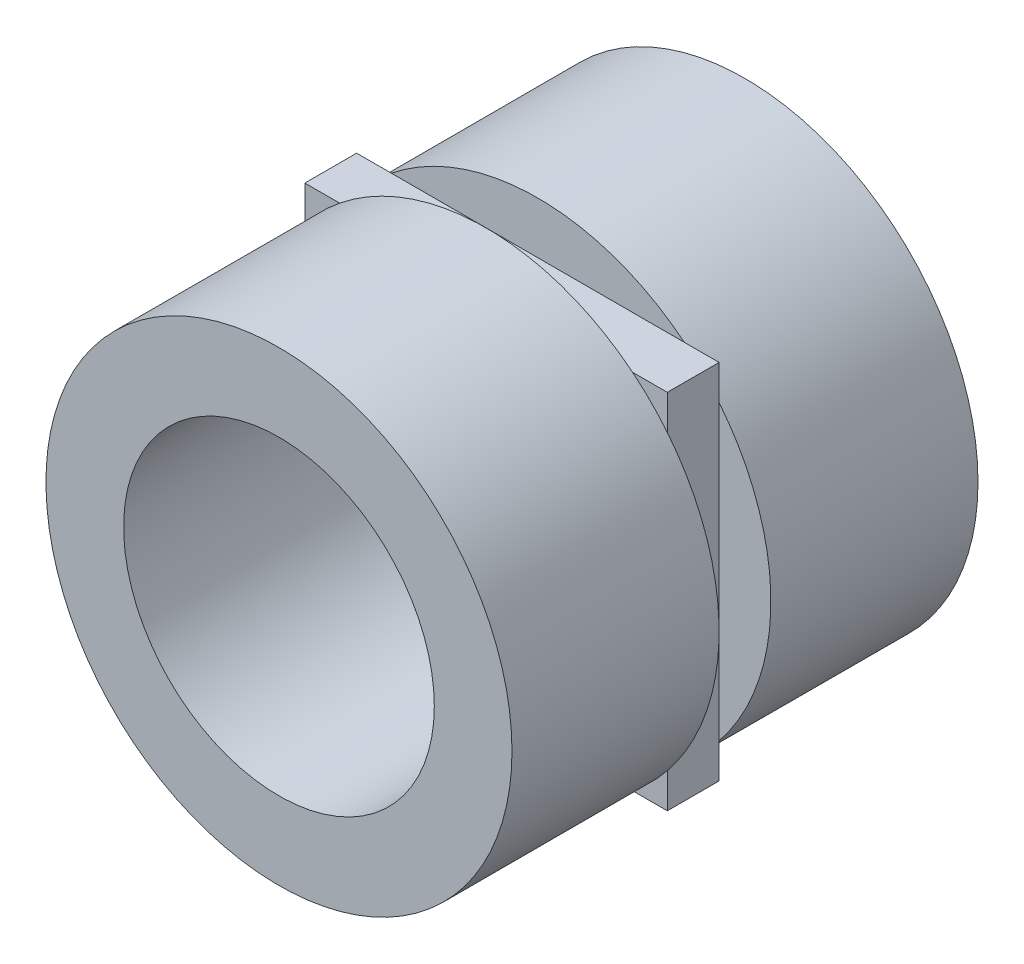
ISO-10303-21;
HEADER;
FILE_DESCRIPTION(('STEP AP214'),'2;1');
FILE_NAME('part.step','',(''),(''),'','','');
FILE_SCHEMA(('AUTOMOTIVE_DESIGN { 1 0 10303 214 1 1 1 1 }'));
ENDSEC;
DATA;
#1=APPLICATION_CONTEXT('core data for automotive mechanical design processes');
#2=APPLICATION_PROTOCOL_DEFINITION('international standard','automotive_design',2000,#1);
#3=PRODUCT_CONTEXT('',#1,'mechanical');
#4=PRODUCT('Part','Part','',(#3));
#5=PRODUCT_RELATED_PRODUCT_CATEGORY('part','',(#4));
#6=PRODUCT_DEFINITION_FORMATION('','',#4);
#7=PRODUCT_DEFINITION_CONTEXT('part definition',#1,'design');
#8=PRODUCT_DEFINITION('design','',#6,#7);
#9=PRODUCT_DEFINITION_SHAPE('','',#8);
#10=(LENGTH_UNIT() NAMED_UNIT(*) SI_UNIT(.MILLI.,.METRE.));
#11=(NAMED_UNIT(*) PLANE_ANGLE_UNIT() SI_UNIT($,.RADIAN.));
#12=(NAMED_UNIT(*) SI_UNIT($,.STERADIAN.) SOLID_ANGLE_UNIT());
#13=UNCERTAINTY_MEASURE_WITH_UNIT(LENGTH_MEASURE(1.E-05),#10,'distance_accuracy_value','');
#14=(GEOMETRIC_REPRESENTATION_CONTEXT(3) GLOBAL_UNCERTAINTY_ASSIGNED_CONTEXT((#13)) GLOBAL_UNIT_ASSIGNED_CONTEXT((#10,
#11,#12)) REPRESENTATION_CONTEXT('',''));
#15=CARTESIAN_POINT('',(0.,0.,0.));
#16=DIRECTION('',(0.,0.,1.));
#17=DIRECTION('',(1.,0.,0.));
#18=AXIS2_PLACEMENT_3D('',#15,#16,#17);
#19=CARTESIAN_POINT('',(0.,0.,4.5));
#20=DIRECTION('',(0.,0.,-1.));
#21=DIRECTION('',(-1.,0.,0.));
#22=AXIS2_PLACEMENT_3D('',#19,#20,#21);
#23=CYLINDRICAL_SURFACE('',#22,4.5);
#24=CARTESIAN_POINT('',(0.,0.,-4.5));
#25=DIRECTION('',(0.,0.,1.));
#26=DIRECTION('',(1.,0.,0.));
#27=AXIS2_PLACEMENT_3D('',#24,#25,#26);
#28=CIRCLE('',#27,4.5);
#29=CARTESIAN_POINT('',(4.5,0.,-4.5));
#30=VERTEX_POINT('',#29);
#31=EDGE_CURVE('E179',#30,#30,#28,.T.);
#32=ORIENTED_EDGE('',*,*,#31,.T.);
#33=EDGE_LOOP('',(#32));
#34=FACE_BOUND('',#33,.T.);
#35=CARTESIAN_POINT('',(0.,0.,-0.5));
#36=DIRECTION('',(0.,0.,-1.));
#37=DIRECTION('',(1.,0.,0.));
#38=AXIS2_PLACEMENT_3D('',#35,#36,#37);
#39=CIRCLE('',#38,4.5);
#40=CARTESIAN_POINT('',(-2.82842712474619,-3.5,-0.5));
#41=VERTEX_POINT('',#40);
#42=CARTESIAN_POINT('',(-3.5,-2.82842712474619,-0.5));
#43=VERTEX_POINT('',#42);
#44=EDGE_CURVE('E129',#41,#43,#39,.T.);
#45=ORIENTED_EDGE('',*,*,#44,.T.);
#46=CARTESIAN_POINT('',(0.,0.,-0.5));
#47=DIRECTION('',(0.,0.,1.));
#48=DIRECTION('',(1.,0.,0.));
#49=AXIS2_PLACEMENT_3D('',#46,#47,#48);
#50=CIRCLE('',#49,4.5);
#51=CARTESIAN_POINT('',(-3.5,2.82842712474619,-0.5));
#52=VERTEX_POINT('',#51);
#53=EDGE_CURVE('E12',#52,#43,#50,.T.);
#54=ORIENTED_EDGE('',*,*,#53,.F.);
#55=CARTESIAN_POINT('',(0.,0.,-0.5));
#56=DIRECTION('',(0.,0.,-1.));
#57=DIRECTION('',(1.,0.,0.));
#58=AXIS2_PLACEMENT_3D('',#55,#56,#57);
#59=CIRCLE('',#58,4.5);
#60=CARTESIAN_POINT('',(-2.82842712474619,3.5,-0.5));
#61=VERTEX_POINT('',#60);
#62=EDGE_CURVE('E214',#52,#61,#59,.T.);
#63=ORIENTED_EDGE('',*,*,#62,.T.);
#64=CARTESIAN_POINT('',(2.82842712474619,3.5,-0.5));
#65=VERTEX_POINT('',#64);
#66=EDGE_CURVE('E43',#65,#61,#50,.T.);
#67=ORIENTED_EDGE('',*,*,#66,.F.);
#68=CARTESIAN_POINT('',(0.,0.,-0.5));
#69=DIRECTION('',(0.,0.,-1.));
#70=DIRECTION('',(1.,0.,0.));
#71=AXIS2_PLACEMENT_3D('',#68,#69,#70);
#72=CIRCLE('',#71,4.5);
#73=CARTESIAN_POINT('',(3.5,2.82842712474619,-0.5));
#74=VERTEX_POINT('',#73);
#75=EDGE_CURVE('E212',#65,#74,#72,.T.);
#76=ORIENTED_EDGE('',*,*,#75,.T.);
#77=CARTESIAN_POINT('',(3.5,-2.82842712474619,-0.5));
#78=VERTEX_POINT('',#77);
#79=EDGE_CURVE('E195',#78,#74,#50,.T.);
#80=ORIENTED_EDGE('',*,*,#79,.F.);
#81=CARTESIAN_POINT('',(0.,0.,-0.5));
#82=DIRECTION('',(0.,0.,-1.));
#83=DIRECTION('',(1.,0.,0.));
#84=AXIS2_PLACEMENT_3D('',#81,#82,#83);
#85=CIRCLE('',#84,4.5);
#86=CARTESIAN_POINT('',(2.82842712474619,-3.5,-0.5));
#87=VERTEX_POINT('',#86);
#88=EDGE_CURVE('E277',#78,#87,#85,.T.);
#89=ORIENTED_EDGE('',*,*,#88,.T.);
#90=EDGE_CURVE('E37',#41,#87,#50,.T.);
#91=ORIENTED_EDGE('',*,*,#90,.F.);
#92=EDGE_LOOP('',(#45,#54,#63,#67,#76,#80,#89,#91));
#93=FACE_BOUND('',#92,.T.);
#94=ADVANCED_FACE('F33',(#34,#93),#23,.T.);
#95=CARTESIAN_POINT('',(0.,0.,0.5));
#96=DIRECTION('',(0.,0.,1.));
#97=DIRECTION('',(1.,0.,0.));
#98=AXIS2_PLACEMENT_3D('',#95,#96,#97);
#99=CIRCLE('',#98,4.5);
#100=CARTESIAN_POINT('',(-3.5,2.82842712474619,0.5));
#101=VERTEX_POINT('',#100);
#102=CARTESIAN_POINT('',(-3.5,-2.82842712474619,0.5));
#103=VERTEX_POINT('',#102);
#104=EDGE_CURVE('E42',#101,#103,#99,.T.);
#105=ORIENTED_EDGE('',*,*,#104,.T.);
#106=CARTESIAN_POINT('',(0.,0.,0.5));
#107=DIRECTION('',(0.,0.,-1.));
#108=DIRECTION('',(1.,0.,0.));
#109=AXIS2_PLACEMENT_3D('',#106,#107,#108);
#110=CIRCLE('',#109,4.5);
#111=CARTESIAN_POINT('',(-2.82842712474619,-3.5,0.5));
#112=VERTEX_POINT('',#111);
#113=EDGE_CURVE('E58',#112,#103,#110,.T.);
#114=ORIENTED_EDGE('',*,*,#113,.F.);
#115=CARTESIAN_POINT('',(2.82842712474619,-3.5,0.5));
#116=VERTEX_POINT('',#115);
#117=EDGE_CURVE('E185',#112,#116,#99,.T.);
#118=ORIENTED_EDGE('',*,*,#117,.T.);
#119=CARTESIAN_POINT('',(0.,0.,0.5));
#120=DIRECTION('',(0.,0.,-1.));
#121=DIRECTION('',(1.,0.,0.));
#122=AXIS2_PLACEMENT_3D('',#119,#120,#121);
#123=CIRCLE('',#122,4.5);
#124=CARTESIAN_POINT('',(3.5,-2.82842712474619,0.5));
#125=VERTEX_POINT('',#124);
#126=EDGE_CURVE('E270',#125,#116,#123,.T.);
#127=ORIENTED_EDGE('',*,*,#126,.F.);
#128=CARTESIAN_POINT('',(3.5,2.82842712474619,0.5));
#129=VERTEX_POINT('',#128);
#130=EDGE_CURVE('E192',#125,#129,#99,.T.);
#131=ORIENTED_EDGE('',*,*,#130,.T.);
#132=CARTESIAN_POINT('',(0.,0.,0.5));
#133=DIRECTION('',(0.,0.,-1.));
#134=DIRECTION('',(1.,0.,0.));
#135=AXIS2_PLACEMENT_3D('',#132,#133,#134);
#136=CIRCLE('',#135,4.5);
#137=CARTESIAN_POINT('',(2.82842712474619,3.5,0.5));
#138=VERTEX_POINT('',#137);
#139=EDGE_CURVE('E260',#138,#129,#136,.T.);
#140=ORIENTED_EDGE('',*,*,#139,.F.);
#141=CARTESIAN_POINT('',(-2.82842712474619,3.5,0.5));
#142=VERTEX_POINT('',#141);
#143=EDGE_CURVE('E197',#138,#142,#99,.T.);
#144=ORIENTED_EDGE('',*,*,#143,.T.);
#145=CARTESIAN_POINT('',(0.,0.,0.5));
#146=DIRECTION('',(0.,0.,-1.));
#147=DIRECTION('',(1.,0.,0.));
#148=AXIS2_PLACEMENT_3D('',#145,#146,#147);
#149=CIRCLE('',#148,4.5);
#150=EDGE_CURVE('E248',#101,#142,#149,.T.);
#151=ORIENTED_EDGE('',*,*,#150,.F.);
#152=EDGE_LOOP('',(#105,#114,#118,#127,#131,#140,#144,#151));
#153=FACE_BOUND('',#152,.T.);
#154=CARTESIAN_POINT('',(0.,0.,4.5));
#155=DIRECTION('',(0.,0.,1.));
#156=DIRECTION('',(1.,0.,0.));
#157=AXIS2_PLACEMENT_3D('',#154,#155,#156);
#158=CIRCLE('',#157,4.5);
#159=CARTESIAN_POINT('',(4.5,0.,4.5));
#160=VERTEX_POINT('',#159);
#161=EDGE_CURVE('E181',#160,#160,#158,.T.);
#162=ORIENTED_EDGE('',*,*,#161,.F.);
#163=EDGE_LOOP('',(#162));
#164=FACE_BOUND('',#163,.T.);
#165=ADVANCED_FACE('F35',(#153,#164),#23,.T.);
#166=CARTESIAN_POINT('',(0.,0.,4.5));
#167=DIRECTION('',(0.,0.,1.));
#168=DIRECTION('',(1.,0.,0.));
#169=AXIS2_PLACEMENT_3D('',#166,#167,#168);
#170=PLANE('',#169);
#171=ORIENTED_EDGE('',*,*,#161,.T.);
#172=EDGE_LOOP('',(#171));
#173=FACE_BOUND('',#172,.T.);
#174=CARTESIAN_POINT('',(0.,0.,4.5));
#175=DIRECTION('',(0.,0.,1.));
#176=DIRECTION('',(1.,0.,0.));
#177=AXIS2_PLACEMENT_3D('',#174,#175,#176);
#178=CIRCLE('',#177,3.);
#179=CARTESIAN_POINT('',(3.,0.,4.5));
#180=VERTEX_POINT('',#179);
#181=EDGE_CURVE('E182',#180,#180,#178,.T.);
#182=ORIENTED_EDGE('',*,*,#181,.F.);
#183=EDGE_LOOP('',(#182));
#184=FACE_BOUND('',#183,.T.);
#185=ADVANCED_FACE('F175',(#173,#184),#170,.T.);
#186=CARTESIAN_POINT('',(0.,0.,-4.5));
#187=DIRECTION('',(0.,0.,1.));
#188=DIRECTION('',(1.,0.,0.));
#189=AXIS2_PLACEMENT_3D('',#186,#187,#188);
#190=PLANE('',#189);
#191=ORIENTED_EDGE('',*,*,#31,.F.);
#192=EDGE_LOOP('',(#191));
#193=FACE_BOUND('',#192,.T.);
#194=CARTESIAN_POINT('',(0.,0.,-4.5));
#195=DIRECTION('',(0.,0.,1.));
#196=DIRECTION('',(1.,0.,0.));
#197=AXIS2_PLACEMENT_3D('',#194,#195,#196);
#198=CIRCLE('',#197,3.);
#199=CARTESIAN_POINT('',(3.,0.,-4.5));
#200=VERTEX_POINT('',#199);
#201=EDGE_CURVE('E188',#200,#200,#198,.T.);
#202=ORIENTED_EDGE('',*,*,#201,.T.);
#203=EDGE_LOOP('',(#202));
#204=FACE_BOUND('',#203,.T.);
#205=ADVANCED_FACE('F464',(#193,#204),#190,.F.);
#206=CARTESIAN_POINT('',(0.,0.,4.5));
#207=DIRECTION('',(0.,0.,-1.));
#208=DIRECTION('',(-1.,0.,0.));
#209=AXIS2_PLACEMENT_3D('',#206,#207,#208);
#210=CYLINDRICAL_SURFACE('',#209,3.);
#211=ORIENTED_EDGE('',*,*,#181,.T.);
#212=EDGE_LOOP('',(#211));
#213=FACE_BOUND('',#212,.T.);
#214=ORIENTED_EDGE('',*,*,#201,.F.);
#215=EDGE_LOOP('',(#214));
#216=FACE_BOUND('',#215,.T.);
#217=ADVANCED_FACE('F325',(#213,#216),#210,.F.);
#218=CARTESIAN_POINT('',(-3.5,-3.5,-0.5));
#219=DIRECTION('',(0.,-1.,0.));
#220=DIRECTION('',(0.,0.,-1.));
#221=AXIS2_PLACEMENT_3D('',#218,#219,#220);
#222=PLANE('',#221);
#223=DIRECTION('',(1.,0.,0.));
#224=VECTOR('',#223,1.);
#225=CARTESIAN_POINT('',(-3.5,-3.5,0.5));
#226=LINE('',#225,#224);
#227=EDGE_CURVE('E238',#112,#116,#226,.T.);
#228=ORIENTED_EDGE('',*,*,#227,.F.);
#229=DIRECTION('',(1.,0.,0.));
#230=VECTOR('',#229,1.);
#231=CARTESIAN_POINT('',(-2.82842712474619,-3.5,0.5));
#232=LINE('',#231,#230);
#233=CARTESIAN_POINT('',(-3.49999999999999,-3.5,0.5));
#234=VERTEX_POINT('',#233);
#235=EDGE_CURVE('E287',#234,#112,#232,.T.);
#236=ORIENTED_EDGE('',*,*,#235,.F.);
#237=DIRECTION('',(0.,0.,-1.));
#238=VECTOR('',#237,1.);
#239=CARTESIAN_POINT('',(-3.49999999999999,-3.5,0.5));
#240=LINE('',#239,#238);
#241=CARTESIAN_POINT('',(-3.49999999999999,-3.5,-0.5));
#242=VERTEX_POINT('',#241);
#243=EDGE_CURVE('E285',#234,#242,#240,.T.);
#244=ORIENTED_EDGE('',*,*,#243,.T.);
#245=DIRECTION('',(1.,0.,0.));
#246=VECTOR('',#245,1.);
#247=CARTESIAN_POINT('',(-2.82842712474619,-3.5,-0.5));
#248=LINE('',#247,#246);
#249=EDGE_CURVE('E131',#242,#41,#248,.T.);
#250=ORIENTED_EDGE('',*,*,#249,.T.);
#251=DIRECTION('',(1.,0.,0.));
#252=VECTOR('',#251,1.);
#253=CARTESIAN_POINT('',(-3.5,-3.5,-0.5));
#254=LINE('',#253,#252);
#255=EDGE_CURVE('E147',#41,#87,#254,.T.);
#256=ORIENTED_EDGE('',*,*,#255,.T.);
#257=DIRECTION('',(1.,0.,0.));
#258=VECTOR('',#257,1.);
#259=CARTESIAN_POINT('',(3.5,-3.5,-0.5));
#260=LINE('',#259,#258);
#261=CARTESIAN_POINT('',(3.5,-3.5,-0.5));
#262=VERTEX_POINT('',#261);
#263=EDGE_CURVE('E282',#87,#262,#260,.T.);
#264=ORIENTED_EDGE('',*,*,#263,.T.);
#265=DIRECTION('',(0.,0.,-1.));
#266=VECTOR('',#265,1.);
#267=CARTESIAN_POINT('',(3.5,-3.5,0.5));
#268=LINE('',#267,#266);
#269=CARTESIAN_POINT('',(3.5,-3.5,0.5));
#270=VERTEX_POINT('',#269);
#271=EDGE_CURVE('E267',#270,#262,#268,.T.);
#272=ORIENTED_EDGE('',*,*,#271,.F.);
#273=DIRECTION('',(1.,0.,0.));
#274=VECTOR('',#273,1.);
#275=CARTESIAN_POINT('',(3.5,-3.5,0.5));
#276=LINE('',#275,#274);
#277=EDGE_CURVE('E274',#116,#270,#276,.T.);
#278=ORIENTED_EDGE('',*,*,#277,.F.);
#279=EDGE_LOOP('',(#228,#236,#244,#250,#256,#264,#272,#278));
#280=FACE_BOUND('',#279,.T.);
#281=ADVANCED_FACE('F294',(#280),#222,.T.);
#282=CARTESIAN_POINT('',(0.,0.,0.5));
#283=DIRECTION('',(0.,0.,1.));
#284=DIRECTION('',(1.,0.,0.));
#285=AXIS2_PLACEMENT_3D('',#282,#283,#284);
#286=PLANE('',#285);
#287=ORIENTED_EDGE('',*,*,#227,.T.);
#288=ORIENTED_EDGE('',*,*,#117,.F.);
#289=EDGE_LOOP('',(#287,#288));
#290=FACE_BOUND('',#289,.T.);
#291=ADVANCED_FACE('F162',(#290),#286,.F.);
#292=CARTESIAN_POINT('',(0.,0.,-0.5));
#293=DIRECTION('',(0.,0.,1.));
#294=DIRECTION('',(1.,0.,0.));
#295=AXIS2_PLACEMENT_3D('',#292,#293,#294);
#296=PLANE('',#295);
#297=ORIENTED_EDGE('',*,*,#90,.T.);
#298=ORIENTED_EDGE('',*,*,#255,.F.);
#299=EDGE_LOOP('',(#297,#298));
#300=FACE_BOUND('',#299,.T.);
#301=ADVANCED_FACE('F155',(#300),#296,.T.);
#302=CARTESIAN_POINT('',(3.5,3.5,-0.5));
#303=DIRECTION('',(1.,0.,0.));
#304=DIRECTION('',(0.,1.,0.));
#305=AXIS2_PLACEMENT_3D('',#302,#303,#304);
#306=PLANE('',#305);
#307=DIRECTION('',(0.,1.,0.));
#308=VECTOR('',#307,1.);
#309=CARTESIAN_POINT('',(3.5,3.5,0.5));
#310=LINE('',#309,#308);
#311=EDGE_CURVE('E235',#125,#129,#310,.T.);
#312=ORIENTED_EDGE('',*,*,#311,.F.);
#313=DIRECTION('',(0.,1.,0.));
#314=VECTOR('',#313,1.);
#315=CARTESIAN_POINT('',(3.5,-3.5,0.5));
#316=LINE('',#315,#314);
#317=EDGE_CURVE('E272',#270,#125,#316,.T.);
#318=ORIENTED_EDGE('',*,*,#317,.F.);
#319=ORIENTED_EDGE('',*,*,#271,.T.);
#320=DIRECTION('',(0.,1.,0.));
#321=VECTOR('',#320,1.);
#322=CARTESIAN_POINT('',(3.5,-3.5,-0.5));
#323=LINE('',#322,#321);
#324=EDGE_CURVE('E279',#262,#78,#323,.T.);
#325=ORIENTED_EDGE('',*,*,#324,.T.);
#326=DIRECTION('',(0.,1.,0.));
#327=VECTOR('',#326,1.);
#328=CARTESIAN_POINT('',(3.5,3.5,-0.5));
#329=LINE('',#328,#327);
#330=EDGE_CURVE('E226',#78,#74,#329,.T.);
#331=ORIENTED_EDGE('',*,*,#330,.T.);
#332=DIRECTION('',(0.,1.,0.));
#333=VECTOR('',#332,1.);
#334=CARTESIAN_POINT('',(3.5,3.5,-0.5));
#335=LINE('',#334,#333);
#336=CARTESIAN_POINT('',(3.5,3.5,-0.5));
#337=VERTEX_POINT('',#336);
#338=EDGE_CURVE('E264',#74,#337,#335,.T.);
#339=ORIENTED_EDGE('',*,*,#338,.T.);
#340=DIRECTION('',(0.,0.,-1.));
#341=VECTOR('',#340,1.);
#342=CARTESIAN_POINT('',(3.5,3.5,0.5));
#343=LINE('',#342,#341);
#344=CARTESIAN_POINT('',(3.5,3.5,0.5));
#345=VERTEX_POINT('',#344);
#346=EDGE_CURVE('E254',#345,#337,#343,.T.);
#347=ORIENTED_EDGE('',*,*,#346,.F.);
#348=DIRECTION('',(0.,1.,0.));
#349=VECTOR('',#348,1.);
#350=CARTESIAN_POINT('',(3.5,3.5,0.5));
#351=LINE('',#350,#349);
#352=EDGE_CURVE('E258',#129,#345,#351,.T.);
#353=ORIENTED_EDGE('',*,*,#352,.F.);
#354=EDGE_LOOP('',(#312,#318,#319,#325,#331,#339,#347,#353));
#355=FACE_BOUND('',#354,.T.);
#356=ADVANCED_FACE('F168',(#355),#306,.T.);
#357=ORIENTED_EDGE('',*,*,#311,.T.);
#358=ORIENTED_EDGE('',*,*,#130,.F.);
#359=EDGE_LOOP('',(#357,#358));
#360=FACE_BOUND('',#359,.T.);
#361=ADVANCED_FACE('F305',(#360),#286,.F.);
#362=ORIENTED_EDGE('',*,*,#79,.T.);
#363=ORIENTED_EDGE('',*,*,#330,.F.);
#364=EDGE_LOOP('',(#362,#363));
#365=FACE_BOUND('',#364,.T.);
#366=ADVANCED_FACE('F165',(#365),#296,.T.);
#367=CARTESIAN_POINT('',(-3.5,3.5,-0.5));
#368=DIRECTION('',(0.,1.,0.));
#369=DIRECTION('',(0.,0.,1.));
#370=AXIS2_PLACEMENT_3D('',#367,#368,#369);
#371=PLANE('',#370);
#372=DIRECTION('',(-1.,0.,0.));
#373=VECTOR('',#372,1.);
#374=CARTESIAN_POINT('',(-3.5,3.5,0.5));
#375=LINE('',#374,#373);
#376=EDGE_CURVE('E148',#138,#142,#375,.T.);
#377=ORIENTED_EDGE('',*,*,#376,.F.);
#378=DIRECTION('',(-1.,0.,0.));
#379=VECTOR('',#378,1.);
#380=CARTESIAN_POINT('',(2.82842712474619,3.5,0.5));
#381=LINE('',#380,#379);
#382=EDGE_CURVE('E256',#345,#138,#381,.T.);
#383=ORIENTED_EDGE('',*,*,#382,.F.);
#384=ORIENTED_EDGE('',*,*,#346,.T.);
#385=DIRECTION('',(-1.,0.,0.));
#386=VECTOR('',#385,1.);
#387=CARTESIAN_POINT('',(2.82842712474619,3.5,-0.5));
#388=LINE('',#387,#386);
#389=EDGE_CURVE('E225',#337,#65,#388,.T.);
#390=ORIENTED_EDGE('',*,*,#389,.T.);
#391=DIRECTION('',(-1.,0.,0.));
#392=VECTOR('',#391,1.);
#393=CARTESIAN_POINT('',(-3.5,3.5,-0.5));
#394=LINE('',#393,#392);
#395=EDGE_CURVE('E209',#65,#61,#394,.T.);
#396=ORIENTED_EDGE('',*,*,#395,.T.);
#397=DIRECTION('',(-1.,0.,0.));
#398=VECTOR('',#397,1.);
#399=CARTESIAN_POINT('',(-3.49999999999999,3.5,-0.5));
#400=LINE('',#399,#398);
#401=CARTESIAN_POINT('',(-3.49999999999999,3.5,-0.5));
#402=VERTEX_POINT('',#401);
#403=EDGE_CURVE('E216',#61,#402,#400,.T.);
#404=ORIENTED_EDGE('',*,*,#403,.T.);
#405=DIRECTION('',(0.,0.,-1.));
#406=VECTOR('',#405,1.);
#407=CARTESIAN_POINT('',(-3.49999999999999,3.5,0.5));
#408=LINE('',#407,#406);
#409=CARTESIAN_POINT('',(-3.49999999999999,3.5,0.5));
#410=VERTEX_POINT('',#409);
#411=EDGE_CURVE('E244',#410,#402,#408,.T.);
#412=ORIENTED_EDGE('',*,*,#411,.F.);
#413=DIRECTION('',(-1.,0.,0.));
#414=VECTOR('',#413,1.);
#415=CARTESIAN_POINT('',(-3.49999999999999,3.5,0.5));
#416=LINE('',#415,#414);
#417=EDGE_CURVE('E246',#142,#410,#416,.T.);
#418=ORIENTED_EDGE('',*,*,#417,.F.);
#419=EDGE_LOOP('',(#377,#383,#384,#390,#396,#404,#412,#418));
#420=FACE_BOUND('',#419,.T.);
#421=ADVANCED_FACE('F221',(#420),#371,.T.);
#422=ORIENTED_EDGE('',*,*,#376,.T.);
#423=ORIENTED_EDGE('',*,*,#143,.F.);
#424=EDGE_LOOP('',(#422,#423));
#425=FACE_BOUND('',#424,.T.);
#426=ADVANCED_FACE('F163',(#425),#286,.F.);
#427=ORIENTED_EDGE('',*,*,#66,.T.);
#428=ORIENTED_EDGE('',*,*,#395,.F.);
#429=EDGE_LOOP('',(#427,#428));
#430=FACE_BOUND('',#429,.T.);
#431=ADVANCED_FACE('F153',(#430),#296,.T.);
#432=ORIENTED_EDGE('',*,*,#53,.T.);
#433=DIRECTION('',(0.,-1.,0.));
#434=VECTOR('',#433,1.);
#435=CARTESIAN_POINT('',(-3.5,3.5,-0.5));
#436=LINE('',#435,#434);
#437=EDGE_CURVE('E143',#52,#43,#436,.T.);
#438=ORIENTED_EDGE('',*,*,#437,.F.);
#439=EDGE_LOOP('',(#432,#438));
#440=FACE_BOUND('',#439,.T.);
#441=ADVANCED_FACE('F150',(#440),#296,.T.);
#442=DIRECTION('',(0.,-1.,0.));
#443=VECTOR('',#442,1.);
#444=CARTESIAN_POINT('',(-3.5,3.5,0.5));
#445=LINE('',#444,#443);
#446=EDGE_CURVE('E241',#101,#103,#445,.T.);
#447=ORIENTED_EDGE('',*,*,#446,.T.);
#448=ORIENTED_EDGE('',*,*,#104,.F.);
#449=EDGE_LOOP('',(#447,#448));
#450=FACE_BOUND('',#449,.T.);
#451=ADVANCED_FACE('F152',(#450),#286,.F.);
#452=CARTESIAN_POINT('',(-3.5,3.5,-0.5));
#453=DIRECTION('',(-1.,0.,0.));
#454=DIRECTION('',(0.,-1.,0.));
#455=AXIS2_PLACEMENT_3D('',#452,#453,#454);
#456=PLANE('',#455);
#457=ORIENTED_EDGE('',*,*,#446,.F.);
#458=DIRECTION('',(0.,-1.,0.));
#459=VECTOR('',#458,1.);
#460=CARTESIAN_POINT('',(-3.49999999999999,3.5,0.5));
#461=LINE('',#460,#459);
#462=EDGE_CURVE('E250',#410,#101,#461,.T.);
#463=ORIENTED_EDGE('',*,*,#462,.F.);
#464=ORIENTED_EDGE('',*,*,#411,.T.);
#465=DIRECTION('',(0.,-1.,0.));
#466=VECTOR('',#465,1.);
#467=CARTESIAN_POINT('',(-3.49999999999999,3.5,-0.5));
#468=LINE('',#467,#466);
#469=EDGE_CURVE('E50',#402,#52,#468,.T.);
#470=ORIENTED_EDGE('',*,*,#469,.T.);
#471=ORIENTED_EDGE('',*,*,#437,.T.);
#472=DIRECTION('',(0.,-1.,0.));
#473=VECTOR('',#472,1.);
#474=CARTESIAN_POINT('',(-3.49999999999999,-3.5,-0.5));
#475=LINE('',#474,#473);
#476=EDGE_CURVE('E126',#43,#242,#475,.T.);
#477=ORIENTED_EDGE('',*,*,#476,.T.);
#478=ORIENTED_EDGE('',*,*,#243,.F.);
#479=DIRECTION('',(0.,-1.,0.));
#480=VECTOR('',#479,1.);
#481=CARTESIAN_POINT('',(-3.49999999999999,-3.5,0.5));
#482=LINE('',#481,#480);
#483=EDGE_CURVE('E289',#103,#234,#482,.T.);
#484=ORIENTED_EDGE('',*,*,#483,.F.);
#485=EDGE_LOOP('',(#457,#463,#464,#470,#471,#477,#478,#484));
#486=FACE_BOUND('',#485,.T.);
#487=ADVANCED_FACE('F145',(#486),#456,.T.);
#488=CARTESIAN_POINT('',(0.,0.,0.5));
#489=DIRECTION('',(0.,0.,1.));
#490=DIRECTION('',(1.,0.,0.));
#491=AXIS2_PLACEMENT_3D('',#488,#489,#490);
#492=PLANE('',#491);
#493=ORIENTED_EDGE('',*,*,#462,.T.);
#494=ORIENTED_EDGE('',*,*,#150,.T.);
#495=ORIENTED_EDGE('',*,*,#417,.T.);
#496=EDGE_LOOP('',(#493,#494,#495));
#497=FACE_BOUND('',#496,.T.);
#498=ADVANCED_FACE('F301',(#497),#492,.T.);
#499=CARTESIAN_POINT('',(0.,0.,-0.5));
#500=DIRECTION('',(0.,0.,1.));
#501=DIRECTION('',(1.,0.,0.));
#502=AXIS2_PLACEMENT_3D('',#499,#500,#501);
#503=PLANE('',#502);
#504=ORIENTED_EDGE('',*,*,#469,.F.);
#505=ORIENTED_EDGE('',*,*,#403,.F.);
#506=ORIENTED_EDGE('',*,*,#62,.F.);
#507=EDGE_LOOP('',(#504,#505,#506));
#508=FACE_BOUND('',#507,.T.);
#509=ADVANCED_FACE('F355',(#508),#503,.F.);
#510=CARTESIAN_POINT('',(0.,0.,0.5));
#511=DIRECTION('',(0.,0.,1.));
#512=DIRECTION('',(1.,0.,0.));
#513=AXIS2_PLACEMENT_3D('',#510,#511,#512);
#514=PLANE('',#513);
#515=ORIENTED_EDGE('',*,*,#139,.T.);
#516=ORIENTED_EDGE('',*,*,#352,.T.);
#517=ORIENTED_EDGE('',*,*,#382,.T.);
#518=EDGE_LOOP('',(#515,#516,#517));
#519=FACE_BOUND('',#518,.T.);
#520=ADVANCED_FACE('F334',(#519),#514,.T.);
#521=CARTESIAN_POINT('',(0.,0.,-0.5));
#522=DIRECTION('',(0.,0.,1.));
#523=DIRECTION('',(1.,0.,0.));
#524=AXIS2_PLACEMENT_3D('',#521,#522,#523);
#525=PLANE('',#524);
#526=ORIENTED_EDGE('',*,*,#75,.F.);
#527=ORIENTED_EDGE('',*,*,#389,.F.);
#528=ORIENTED_EDGE('',*,*,#338,.F.);
#529=EDGE_LOOP('',(#526,#527,#528));
#530=FACE_BOUND('',#529,.T.);
#531=ADVANCED_FACE('F336',(#530),#525,.F.);
#532=CARTESIAN_POINT('',(0.,0.,0.5));
#533=DIRECTION('',(0.,0.,1.));
#534=DIRECTION('',(1.,0.,0.));
#535=AXIS2_PLACEMENT_3D('',#532,#533,#534);
#536=PLANE('',#535);
#537=ORIENTED_EDGE('',*,*,#277,.T.);
#538=ORIENTED_EDGE('',*,*,#317,.T.);
#539=ORIENTED_EDGE('',*,*,#126,.T.);
#540=EDGE_LOOP('',(#537,#538,#539));
#541=FACE_BOUND('',#540,.T.);
#542=ADVANCED_FACE('F330',(#541),#536,.T.);
#543=CARTESIAN_POINT('',(0.,0.,-0.5));
#544=DIRECTION('',(0.,0.,1.));
#545=DIRECTION('',(1.,0.,0.));
#546=AXIS2_PLACEMENT_3D('',#543,#544,#545);
#547=PLANE('',#546);
#548=ORIENTED_EDGE('',*,*,#263,.F.);
#549=ORIENTED_EDGE('',*,*,#88,.F.);
#550=ORIENTED_EDGE('',*,*,#324,.F.);
#551=EDGE_LOOP('',(#548,#549,#550));
#552=FACE_BOUND('',#551,.T.);
#553=ADVANCED_FACE('F339',(#552),#547,.F.);
#554=CARTESIAN_POINT('',(0.,0.,0.5));
#555=DIRECTION('',(0.,0.,1.));
#556=DIRECTION('',(1.,0.,0.));
#557=AXIS2_PLACEMENT_3D('',#554,#555,#556);
#558=PLANE('',#557);
#559=ORIENTED_EDGE('',*,*,#113,.T.);
#560=ORIENTED_EDGE('',*,*,#483,.T.);
#561=ORIENTED_EDGE('',*,*,#235,.T.);
#562=EDGE_LOOP('',(#559,#560,#561));
#563=FACE_BOUND('',#562,.T.);
#564=ADVANCED_FACE('F341',(#563),#558,.T.);
#565=CARTESIAN_POINT('',(0.,0.,-0.5));
#566=DIRECTION('',(0.,0.,1.));
#567=DIRECTION('',(1.,0.,0.));
#568=AXIS2_PLACEMENT_3D('',#565,#566,#567);
#569=PLANE('',#568);
#570=ORIENTED_EDGE('',*,*,#44,.F.);
#571=ORIENTED_EDGE('',*,*,#249,.F.);
#572=ORIENTED_EDGE('',*,*,#476,.F.);
#573=EDGE_LOOP('',(#570,#571,#572));
#574=FACE_BOUND('',#573,.T.);
#575=ADVANCED_FACE('F128',(#574),#569,.F.);
#576=CLOSED_SHELL('',(#94,#165,#185,#205,#217,#281,#291,#301,#356,#361,#366,#421,#426,#431,#441,
#451,#487,#498,#509,#520,#531,#542,#553,#564,#575));
#577=MANIFOLD_SOLID_BREP('B2',#576);
#578=ADVANCED_BREP_SHAPE_REPRESENTATION('',(#18,#577),#14);
#579=SHAPE_DEFINITION_REPRESENTATION(#9,#578);
ENDSEC;
END-ISO-10303-21;
